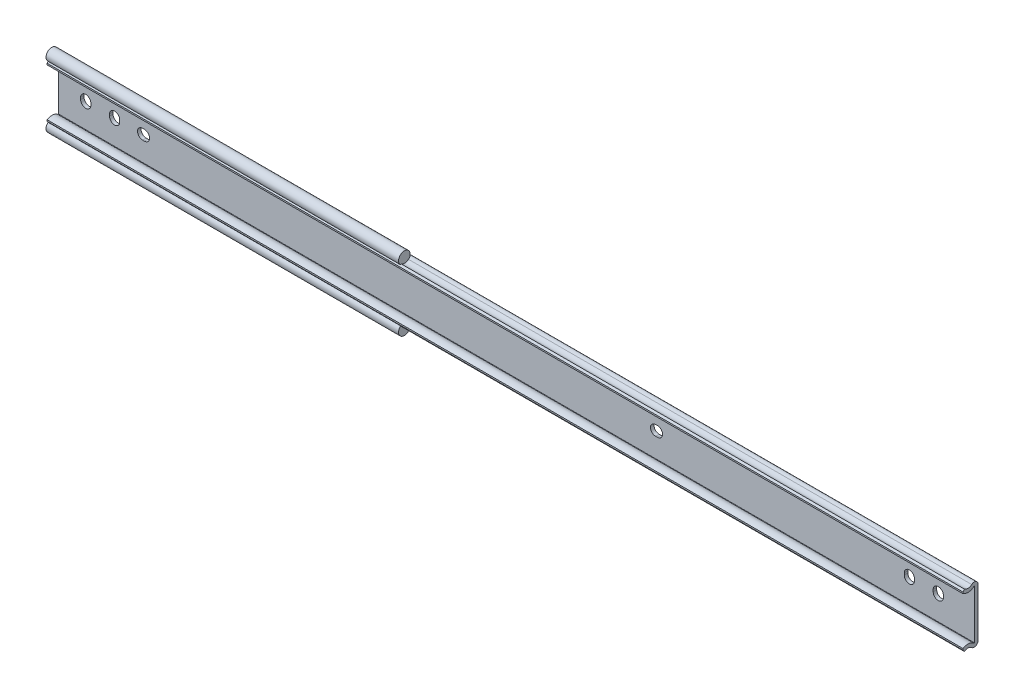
ISO-10303-21;
HEADER;
FILE_DESCRIPTION(('STEP AP214'),'2;1');
FILE_NAME('part.step','',(''),(''),'','','');
FILE_SCHEMA(('AUTOMOTIVE_DESIGN { 1 0 10303 214 1 1 1 1 }'));
ENDSEC;
DATA;
#1=APPLICATION_CONTEXT('core data for automotive mechanical design processes');
#2=APPLICATION_PROTOCOL_DEFINITION('international standard','automotive_design',2000,#1);
#3=PRODUCT_CONTEXT('',#1,'mechanical');
#4=PRODUCT('Part','Part','',(#3));
#5=PRODUCT_RELATED_PRODUCT_CATEGORY('part','',(#4));
#6=PRODUCT_DEFINITION_FORMATION('','',#4);
#7=PRODUCT_DEFINITION_CONTEXT('part definition',#1,'design');
#8=PRODUCT_DEFINITION('design','',#6,#7);
#9=PRODUCT_DEFINITION_SHAPE('','',#8);
#10=(LENGTH_UNIT() NAMED_UNIT(*) SI_UNIT(.MILLI.,.METRE.));
#11=(NAMED_UNIT(*) PLANE_ANGLE_UNIT() SI_UNIT($,.RADIAN.));
#12=(NAMED_UNIT(*) SI_UNIT($,.STERADIAN.) SOLID_ANGLE_UNIT());
#13=UNCERTAINTY_MEASURE_WITH_UNIT(LENGTH_MEASURE(1.E-05),#10,'distance_accuracy_value','');
#14=(GEOMETRIC_REPRESENTATION_CONTEXT(3) GLOBAL_UNCERTAINTY_ASSIGNED_CONTEXT((#13)) GLOBAL_UNIT_ASSIGNED_CONTEXT((#10,
#11,#12)) REPRESENTATION_CONTEXT('',''));
#15=CARTESIAN_POINT('',(0.,0.,0.));
#16=DIRECTION('',(0.,0.,1.));
#17=DIRECTION('',(1.,0.,0.));
#18=AXIS2_PLACEMENT_3D('',#15,#16,#17);
#19=CARTESIAN_POINT('',(147.,13.575,4.55));
#20=DIRECTION('',(-1.,0.,0.));
#21=DIRECTION('',(0.,0.,1.));
#22=AXIS2_PLACEMENT_3D('',#19,#20,#21);
#23=CYLINDRICAL_SURFACE('',#22,2.55);
#24=DIRECTION('',(-1.,0.,0.));
#25=VECTOR('',#24,1.);
#26=CARTESIAN_POINT('',(147.,11.6159967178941,6.18242339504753));
#27=LINE('',#26,#25);
#28=CARTESIAN_POINT('',(-11.9,11.6159967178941,6.18242339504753));
#29=VERTEX_POINT('',#28);
#30=CARTESIAN_POINT('',(143.,11.6159967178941,6.18242339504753));
#31=VERTEX_POINT('',#30);
#32=EDGE_CURVE('E22',#29,#31,#27,.F.);
#33=ORIENTED_EDGE('',*,*,#32,.T.);
#34=CARTESIAN_POINT('',(143.,13.575,4.55));
#35=DIRECTION('',(1.,0.,0.));
#36=DIRECTION('',(0.,0.,-1.));
#37=AXIS2_PLACEMENT_3D('',#34,#35,#36);
#38=CIRCLE('',#37,2.55);
#39=CARTESIAN_POINT('',(143.,12.266917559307,2.3610686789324));
#40=VERTEX_POINT('',#39);
#41=EDGE_CURVE('E294',#40,#31,#38,.T.);
#42=ORIENTED_EDGE('',*,*,#41,.F.);
#43=DIRECTION('',(-1.,0.,0.));
#44=VECTOR('',#43,1.);
#45=CARTESIAN_POINT('',(67.55,12.266917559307,2.36106867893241));
#46=LINE('',#45,#44);
#47=CARTESIAN_POINT('',(-11.9,12.266917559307,2.36106867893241));
#48=VERTEX_POINT('',#47);
#49=EDGE_CURVE('E581',#40,#48,#46,.T.);
#50=ORIENTED_EDGE('',*,*,#49,.T.);
#51=CARTESIAN_POINT('',(-11.9,13.575,4.55));
#52=DIRECTION('',(-1.,0.,0.));
#53=DIRECTION('',(0.,0.,1.));
#54=AXIS2_PLACEMENT_3D('',#51,#52,#53);
#55=CIRCLE('',#54,2.55);
#56=EDGE_CURVE('E305',#29,#48,#55,.T.);
#57=ORIENTED_EDGE('',*,*,#56,.F.);
#58=EDGE_LOOP('',(#33,#42,#50,#57));
#59=FACE_BOUND('',#58,.T.);
#60=ADVANCED_FACE('F14',(#59),#23,.T.);
#61=CARTESIAN_POINT('',(147.,-13.575,4.55));
#62=DIRECTION('',(-1.,0.,0.));
#63=DIRECTION('',(0.,0.,1.));
#64=AXIS2_PLACEMENT_3D('',#61,#62,#63);
#65=CYLINDRICAL_SURFACE('',#64,2.55);
#66=DIRECTION('',(-1.,0.,0.));
#67=VECTOR('',#66,1.);
#68=CARTESIAN_POINT('',(67.55,-12.2669175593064,2.36106867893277));
#69=LINE('',#68,#67);
#70=CARTESIAN_POINT('',(-11.9,-12.2669175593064,2.36106867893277));
#71=VERTEX_POINT('',#70);
#72=CARTESIAN_POINT('',(143.,-12.2669175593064,2.36106867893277));
#73=VERTEX_POINT('',#72);
#74=EDGE_CURVE('E29',#71,#73,#69,.F.);
#75=ORIENTED_EDGE('',*,*,#74,.T.);
#76=CARTESIAN_POINT('',(143.,-13.575,4.55));
#77=DIRECTION('',(1.,0.,0.));
#78=DIRECTION('',(0.,0.,-1.));
#79=AXIS2_PLACEMENT_3D('',#76,#77,#78);
#80=CIRCLE('',#79,2.55);
#81=CARTESIAN_POINT('',(143.,-11.615996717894,6.18242339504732));
#82=VERTEX_POINT('',#81);
#83=EDGE_CURVE('E595',#82,#73,#80,.T.);
#84=ORIENTED_EDGE('',*,*,#83,.F.);
#85=DIRECTION('',(-1.,0.,0.));
#86=VECTOR('',#85,1.);
#87=CARTESIAN_POINT('',(147.,-11.615996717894,6.18242339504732));
#88=LINE('',#87,#86);
#89=CARTESIAN_POINT('',(-11.9,-11.615996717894,6.18242339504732));
#90=VERTEX_POINT('',#89);
#91=EDGE_CURVE('E9',#82,#90,#88,.T.);
#92=ORIENTED_EDGE('',*,*,#91,.T.);
#93=CARTESIAN_POINT('',(-11.9,-13.575,4.55));
#94=DIRECTION('',(-1.,0.,0.));
#95=DIRECTION('',(0.,0.,-1.));
#96=AXIS2_PLACEMENT_3D('',#93,#94,#95);
#97=CIRCLE('',#96,2.55);
#98=EDGE_CURVE('E585',#71,#90,#97,.T.);
#99=ORIENTED_EDGE('',*,*,#98,.F.);
#100=EDGE_LOOP('',(#75,#84,#92,#99));
#101=FACE_BOUND('',#100,.T.);
#102=ADVANCED_FACE('F620',(#101),#65,.T.);
#103=CARTESIAN_POINT('',(-11.9,13.9150000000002,4.44999999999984));
#104=DIRECTION('',(1.,0.,0.));
#105=DIRECTION('',(0.,0.,-1.));
#106=AXIS2_PLACEMENT_3D('',#103,#104,#105);
#107=CYLINDRICAL_SURFACE('',#106,2.55000000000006);
#108=DIRECTION('',(1.,0.,0.));
#109=VECTOR('',#108,1.);
#110=CARTESIAN_POINT('',(-11.9,12.0059666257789,2.75941087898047));
#111=LINE('',#110,#109);
#112=CARTESIAN_POINT('',(143.,12.0059666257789,2.75941087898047));
#113=VERTEX_POINT('',#112);
#114=CARTESIAN_POINT('',(390.5,12.0059666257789,2.75941087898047));
#115=VERTEX_POINT('',#114);
#116=EDGE_CURVE('E361',#113,#115,#111,.T.);
#117=ORIENTED_EDGE('',*,*,#116,.F.);
#118=CARTESIAN_POINT('',(143.,13.9150000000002,4.44999999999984));
#119=DIRECTION('',(1.,0.,0.));
#120=DIRECTION('',(0.,0.,-1.));
#121=AXIS2_PLACEMENT_3D('',#118,#119,#120);
#122=CIRCLE('',#121,2.55);
#123=CARTESIAN_POINT('',(143.,11.8784795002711,5.98462837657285));
#124=VERTEX_POINT('',#123);
#125=EDGE_CURVE('E293',#124,#113,#122,.T.);
#126=ORIENTED_EDGE('',*,*,#125,.F.);
#127=DIRECTION('',(1.,0.,0.));
#128=VECTOR('',#127,1.);
#129=CARTESIAN_POINT('',(-11.9,11.8784795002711,5.98462837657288));
#130=LINE('',#129,#128);
#131=CARTESIAN_POINT('',(390.5,11.8784795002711,5.98462837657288));
#132=VERTEX_POINT('',#131);
#133=EDGE_CURVE('E289',#124,#132,#130,.T.);
#134=ORIENTED_EDGE('',*,*,#133,.T.);
#135=CARTESIAN_POINT('',(390.5,13.9150000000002,4.44999999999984));
#136=DIRECTION('',(-1.,0.,0.));
#137=DIRECTION('',(0.,0.,1.));
#138=AXIS2_PLACEMENT_3D('',#135,#136,#137);
#139=CIRCLE('',#138,2.55000000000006);
#140=EDGE_CURVE('E458',#115,#132,#139,.T.);
#141=ORIENTED_EDGE('',*,*,#140,.F.);
#142=EDGE_LOOP('',(#117,#126,#134,#141));
#143=FACE_BOUND('',#142,.T.);
#144=ADVANCED_FACE('F16',(#143),#107,.F.);
#145=CARTESIAN_POINT('',(-11.9,-10.7622239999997,0.));
#146=DIRECTION('',(0.,0.,-1.));
#147=DIRECTION('',(-1.,0.,0.));
#148=AXIS2_PLACEMENT_3D('',#145,#146,#147);
#149=PLANE('',#148);
#150=DIRECTION('',(0.,1.,0.));
#151=VECTOR('',#150,1.);
#152=CARTESIAN_POINT('',(-11.9,-10.7622239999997,0.));
#153=LINE('',#152,#151);
#154=CARTESIAN_POINT('',(-11.9,-10.7622239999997,0.));
#155=VERTEX_POINT('',#154);
#156=CARTESIAN_POINT('',(-11.9,10.7622240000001,0.));
#157=VERTEX_POINT('',#156);
#158=EDGE_CURVE('E392',#155,#157,#153,.T.);
#159=ORIENTED_EDGE('',*,*,#158,.T.);
#160=DIRECTION('',(1.,0.,0.));
#161=VECTOR('',#160,1.);
#162=CARTESIAN_POINT('',(-11.9,10.7622240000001,0.));
#163=LINE('',#162,#161);
#164=CARTESIAN_POINT('',(390.5,10.7622240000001,0.));
#165=VERTEX_POINT('',#164);
#166=EDGE_CURVE('E387',#157,#165,#163,.T.);
#167=ORIENTED_EDGE('',*,*,#166,.T.);
#168=DIRECTION('',(0.,1.,0.));
#169=VECTOR('',#168,1.);
#170=CARTESIAN_POINT('',(390.5,-10.7622239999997,0.));
#171=LINE('',#170,#169);
#172=CARTESIAN_POINT('',(390.5,-10.7622239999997,0.));
#173=VERTEX_POINT('',#172);
#174=EDGE_CURVE('E423',#173,#165,#171,.T.);
#175=ORIENTED_EDGE('',*,*,#174,.F.);
#176=DIRECTION('',(1.,0.,0.));
#177=VECTOR('',#176,1.);
#178=CARTESIAN_POINT('',(-11.9,-10.7622239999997,0.));
#179=LINE('',#178,#177);
#180=EDGE_CURVE('E384',#155,#173,#179,.T.);
#181=ORIENTED_EDGE('',*,*,#180,.F.);
#182=EDGE_LOOP('',(#159,#167,#175,#181));
#183=FACE_BOUND('',#182,.T.);
#184=CARTESIAN_POINT('',(251.2,2.32452945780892E-13,0.));
#185=DIRECTION('',(0.,0.,-1.));
#186=DIRECTION('',(-1.,0.,0.));
#187=AXIS2_PLACEMENT_3D('',#184,#185,#186);
#188=CIRCLE('',#187,2.25);
#189=CARTESIAN_POINT('',(251.2,2.25000000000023,0.));
#190=VERTEX_POINT('',#189);
#191=CARTESIAN_POINT('',(251.2,-2.24999999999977,0.));
#192=VERTEX_POINT('',#191);
#193=EDGE_CURVE('E579',#190,#192,#188,.T.);
#194=ORIENTED_EDGE('',*,*,#193,.F.);
#195=DIRECTION('',(1.,0.,0.));
#196=VECTOR('',#195,1.);
#197=CARTESIAN_POINT('',(251.2,2.25000000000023,0.));
#198=LINE('',#197,#196);
#199=CARTESIAN_POINT('',(250.4,2.25000000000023,0.));
#200=VERTEX_POINT('',#199);
#201=EDGE_CURVE('E566',#200,#190,#198,.T.);
#202=ORIENTED_EDGE('',*,*,#201,.F.);
#203=CARTESIAN_POINT('',(250.4,2.32452945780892E-13,0.));
#204=DIRECTION('',(0.,0.,-1.));
#205=DIRECTION('',(-1.,0.,0.));
#206=AXIS2_PLACEMENT_3D('',#203,#204,#205);
#207=CIRCLE('',#206,2.25);
#208=CARTESIAN_POINT('',(250.4,-2.24999999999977,0.));
#209=VERTEX_POINT('',#208);
#210=EDGE_CURVE('E573',#209,#200,#207,.T.);
#211=ORIENTED_EDGE('',*,*,#210,.F.);
#212=DIRECTION('',(-1.,0.,0.));
#213=VECTOR('',#212,1.);
#214=CARTESIAN_POINT('',(251.2,-2.24999999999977,0.));
#215=LINE('',#214,#213);
#216=EDGE_CURVE('E576',#192,#209,#215,.T.);
#217=ORIENTED_EDGE('',*,*,#216,.F.);
#218=EDGE_LOOP('',(#194,#202,#211,#217));
#219=FACE_BOUND('',#218,.T.);
#220=CARTESIAN_POINT('',(25.000000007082,0.00222400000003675,0.));
#221=DIRECTION('',(0.,0.,-1.));
#222=DIRECTION('',(-1.,0.,0.));
#223=AXIS2_PLACEMENT_3D('',#220,#221,#222);
#224=CIRCLE('',#223,2.25);
#225=CARTESIAN_POINT('',(25.000000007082,-2.24777599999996,0.));
#226=VERTEX_POINT('',#225);
#227=CARTESIAN_POINT('',(25.000000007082,2.25222400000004,0.));
#228=VERTEX_POINT('',#227);
#229=EDGE_CURVE('E559',#226,#228,#224,.T.);
#230=ORIENTED_EDGE('',*,*,#229,.F.);
#231=DIRECTION('',(-1.,0.,0.));
#232=VECTOR('',#231,1.);
#233=CARTESIAN_POINT('',(25.800000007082,-2.24777599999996,0.));
#234=LINE('',#233,#232);
#235=CARTESIAN_POINT('',(25.800000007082,-2.24777599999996,0.));
#236=VERTEX_POINT('',#235);
#237=EDGE_CURVE('E546',#236,#226,#234,.T.);
#238=ORIENTED_EDGE('',*,*,#237,.F.);
#239=CARTESIAN_POINT('',(25.800000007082,0.00222400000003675,0.));
#240=DIRECTION('',(0.,0.,-1.));
#241=DIRECTION('',(-1.,0.,0.));
#242=AXIS2_PLACEMENT_3D('',#239,#240,#241);
#243=CIRCLE('',#242,2.25);
#244=CARTESIAN_POINT('',(25.800000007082,2.25222400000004,0.));
#245=VERTEX_POINT('',#244);
#246=EDGE_CURVE('E553',#245,#236,#243,.T.);
#247=ORIENTED_EDGE('',*,*,#246,.F.);
#248=DIRECTION('',(1.,0.,0.));
#249=VECTOR('',#248,1.);
#250=CARTESIAN_POINT('',(25.000000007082,2.25222400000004,0.));
#251=LINE('',#250,#249);
#252=EDGE_CURVE('E556',#228,#245,#251,.T.);
#253=ORIENTED_EDGE('',*,*,#252,.F.);
#254=EDGE_LOOP('',(#230,#238,#247,#253));
#255=FACE_BOUND('',#254,.T.);
#256=CARTESIAN_POINT('',(0.,-0.400000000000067,0.));
#257=DIRECTION('',(0.,0.,-1.));
#258=DIRECTION('',(1.,0.,0.));
#259=AXIS2_PLACEMENT_3D('',#256,#257,#258);
#260=CIRCLE('',#259,2.24999999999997);
#261=CARTESIAN_POINT('',(2.25000000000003,-0.400000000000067,0.));
#262=VERTEX_POINT('',#261);
#263=CARTESIAN_POINT('',(-2.24999999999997,-0.400000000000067,0.));
#264=VERTEX_POINT('',#263);
#265=EDGE_CURVE('E539',#262,#264,#260,.T.);
#266=ORIENTED_EDGE('',*,*,#265,.F.);
#267=DIRECTION('',(0.,-1.,0.));
#268=VECTOR('',#267,1.);
#269=CARTESIAN_POINT('',(2.25000000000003,-0.400000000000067,0.));
#270=LINE('',#269,#268);
#271=CARTESIAN_POINT('',(2.25000000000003,0.400000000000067,0.));
#272=VERTEX_POINT('',#271);
#273=EDGE_CURVE('E526',#272,#262,#270,.T.);
#274=ORIENTED_EDGE('',*,*,#273,.F.);
#275=CARTESIAN_POINT('',(0.,0.400000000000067,0.));
#276=DIRECTION('',(0.,0.,-1.));
#277=DIRECTION('',(1.,0.,0.));
#278=AXIS2_PLACEMENT_3D('',#275,#276,#277);
#279=CIRCLE('',#278,2.24999999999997);
#280=CARTESIAN_POINT('',(-2.24999999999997,0.400000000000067,0.));
#281=VERTEX_POINT('',#280);
#282=EDGE_CURVE('E533',#281,#272,#279,.T.);
#283=ORIENTED_EDGE('',*,*,#282,.F.);
#284=DIRECTION('',(0.,1.,0.));
#285=VECTOR('',#284,1.);
#286=CARTESIAN_POINT('',(-2.24999999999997,-0.400000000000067,0.));
#287=LINE('',#286,#285);
#288=EDGE_CURVE('E536',#264,#281,#287,.T.);
#289=ORIENTED_EDGE('',*,*,#288,.F.);
#290=EDGE_LOOP('',(#266,#274,#283,#289));
#291=FACE_BOUND('',#290,.T.);
#292=CARTESIAN_POINT('',(12.7,-0.400000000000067,0.));
#293=DIRECTION('',(0.,0.,-1.));
#294=DIRECTION('',(1.,0.,0.));
#295=AXIS2_PLACEMENT_3D('',#292,#293,#294);
#296=CIRCLE('',#295,2.24999999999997);
#297=CARTESIAN_POINT('',(14.95,-0.400000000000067,0.));
#298=VERTEX_POINT('',#297);
#299=CARTESIAN_POINT('',(10.45,-0.400000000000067,0.));
#300=VERTEX_POINT('',#299);
#301=EDGE_CURVE('E519',#298,#300,#296,.T.);
#302=ORIENTED_EDGE('',*,*,#301,.F.);
#303=DIRECTION('',(0.,-1.,0.));
#304=VECTOR('',#303,1.);
#305=CARTESIAN_POINT('',(14.95,-0.400000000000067,0.));
#306=LINE('',#305,#304);
#307=CARTESIAN_POINT('',(14.95,0.400000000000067,0.));
#308=VERTEX_POINT('',#307);
#309=EDGE_CURVE('E506',#308,#298,#306,.T.);
#310=ORIENTED_EDGE('',*,*,#309,.F.);
#311=CARTESIAN_POINT('',(12.7,0.400000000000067,0.));
#312=DIRECTION('',(0.,0.,-1.));
#313=DIRECTION('',(1.,0.,0.));
#314=AXIS2_PLACEMENT_3D('',#311,#312,#313);
#315=CIRCLE('',#314,2.24999999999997);
#316=CARTESIAN_POINT('',(10.45,0.400000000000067,0.));
#317=VERTEX_POINT('',#316);
#318=EDGE_CURVE('E513',#317,#308,#315,.T.);
#319=ORIENTED_EDGE('',*,*,#318,.F.);
#320=DIRECTION('',(0.,1.,0.));
#321=VECTOR('',#320,1.);
#322=CARTESIAN_POINT('',(10.45,-0.400000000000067,0.));
#323=LINE('',#322,#321);
#324=EDGE_CURVE('E516',#300,#317,#323,.T.);
#325=ORIENTED_EDGE('',*,*,#324,.F.);
#326=EDGE_LOOP('',(#302,#310,#319,#325));
#327=FACE_BOUND('',#326,.T.);
#328=CARTESIAN_POINT('',(361.9,-0.400000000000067,0.));
#329=DIRECTION('',(0.,0.,-1.));
#330=DIRECTION('',(1.,0.,0.));
#331=AXIS2_PLACEMENT_3D('',#328,#329,#330);
#332=CIRCLE('',#331,2.24999999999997);
#333=CARTESIAN_POINT('',(364.15,-0.400000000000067,0.));
#334=VERTEX_POINT('',#333);
#335=CARTESIAN_POINT('',(359.65,-0.400000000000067,0.));
#336=VERTEX_POINT('',#335);
#337=EDGE_CURVE('E499',#334,#336,#332,.T.);
#338=ORIENTED_EDGE('',*,*,#337,.F.);
#339=DIRECTION('',(0.,-1.,0.));
#340=VECTOR('',#339,1.);
#341=CARTESIAN_POINT('',(364.15,-0.400000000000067,0.));
#342=LINE('',#341,#340);
#343=CARTESIAN_POINT('',(364.15,0.400000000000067,0.));
#344=VERTEX_POINT('',#343);
#345=EDGE_CURVE('E486',#344,#334,#342,.T.);
#346=ORIENTED_EDGE('',*,*,#345,.F.);
#347=CARTESIAN_POINT('',(361.9,0.400000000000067,0.));
#348=DIRECTION('',(0.,0.,-1.));
#349=DIRECTION('',(1.,0.,0.));
#350=AXIS2_PLACEMENT_3D('',#347,#348,#349);
#351=CIRCLE('',#350,2.24999999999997);
#352=CARTESIAN_POINT('',(359.65,0.400000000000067,0.));
#353=VERTEX_POINT('',#352);
#354=EDGE_CURVE('E493',#353,#344,#351,.T.);
#355=ORIENTED_EDGE('',*,*,#354,.F.);
#356=DIRECTION('',(0.,1.,0.));
#357=VECTOR('',#356,1.);
#358=CARTESIAN_POINT('',(359.65,-0.400000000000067,0.));
#359=LINE('',#358,#357);
#360=EDGE_CURVE('E496',#336,#353,#359,.T.);
#361=ORIENTED_EDGE('',*,*,#360,.F.);
#362=EDGE_LOOP('',(#338,#346,#355,#361));
#363=FACE_BOUND('',#362,.T.);
#364=CARTESIAN_POINT('',(374.6,-0.400000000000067,0.));
#365=DIRECTION('',(0.,0.,-1.));
#366=DIRECTION('',(1.,0.,0.));
#367=AXIS2_PLACEMENT_3D('',#364,#365,#366);
#368=CIRCLE('',#367,2.24999999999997);
#369=CARTESIAN_POINT('',(376.85,-0.400000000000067,0.));
#370=VERTEX_POINT('',#369);
#371=CARTESIAN_POINT('',(372.35,-0.400000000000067,0.));
#372=VERTEX_POINT('',#371);
#373=EDGE_CURVE('E479',#370,#372,#368,.T.);
#374=ORIENTED_EDGE('',*,*,#373,.F.);
#375=DIRECTION('',(0.,-1.,0.));
#376=VECTOR('',#375,1.);
#377=CARTESIAN_POINT('',(376.85,-0.400000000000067,0.));
#378=LINE('',#377,#376);
#379=CARTESIAN_POINT('',(376.85,0.400000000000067,0.));
#380=VERTEX_POINT('',#379);
#381=EDGE_CURVE('E466',#380,#370,#378,.T.);
#382=ORIENTED_EDGE('',*,*,#381,.F.);
#383=CARTESIAN_POINT('',(374.6,0.400000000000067,0.));
#384=DIRECTION('',(0.,0.,-1.));
#385=DIRECTION('',(1.,0.,0.));
#386=AXIS2_PLACEMENT_3D('',#383,#384,#385);
#387=CIRCLE('',#386,2.24999999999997);
#388=CARTESIAN_POINT('',(372.35,0.400000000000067,0.));
#389=VERTEX_POINT('',#388);
#390=EDGE_CURVE('E473',#389,#380,#387,.T.);
#391=ORIENTED_EDGE('',*,*,#390,.F.);
#392=DIRECTION('',(0.,1.,0.));
#393=VECTOR('',#392,1.);
#394=CARTESIAN_POINT('',(372.35,-0.400000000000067,0.));
#395=LINE('',#394,#393);
#396=EDGE_CURVE('E476',#372,#389,#395,.T.);
#397=ORIENTED_EDGE('',*,*,#396,.F.);
#398=EDGE_LOOP('',(#374,#382,#391,#397));
#399=FACE_BOUND('',#398,.T.);
#400=ADVANCED_FACE('F619',(#183,#219,#255,#291,#327,#363,#399),#149,.T.);
#401=CARTESIAN_POINT('',(-11.9,10.7622240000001,1.54999999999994));
#402=DIRECTION('',(0.,0.,1.));
#403=DIRECTION('',(1.,0.,0.));
#404=AXIS2_PLACEMENT_3D('',#401,#402,#403);
#405=PLANE('',#404);
#406=DIRECTION('',(0.,-1.,0.));
#407=VECTOR('',#406,1.);
#408=CARTESIAN_POINT('',(-11.9,10.7622240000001,1.54999999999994));
#409=LINE('',#408,#407);
#410=CARTESIAN_POINT('',(-11.9,10.7622240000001,1.54999999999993));
#411=VERTEX_POINT('',#410);
#412=CARTESIAN_POINT('',(-11.9,-10.7622239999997,1.54999999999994));
#413=VERTEX_POINT('',#412);
#414=EDGE_CURVE('E407',#411,#413,#409,.T.);
#415=ORIENTED_EDGE('',*,*,#414,.T.);
#416=DIRECTION('',(1.,0.,0.));
#417=VECTOR('',#416,1.);
#418=CARTESIAN_POINT('',(-11.9,-10.7622239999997,1.54999999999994));
#419=LINE('',#418,#417);
#420=CARTESIAN_POINT('',(390.5,-10.7622239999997,1.54999999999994));
#421=VERTEX_POINT('',#420);
#422=EDGE_CURVE('E372',#413,#421,#419,.T.);
#423=ORIENTED_EDGE('',*,*,#422,.T.);
#424=DIRECTION('',(0.,-1.,0.));
#425=VECTOR('',#424,1.);
#426=CARTESIAN_POINT('',(390.5,10.7622240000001,1.54999999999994));
#427=LINE('',#426,#425);
#428=CARTESIAN_POINT('',(390.5,10.7622240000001,1.54999999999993));
#429=VERTEX_POINT('',#428);
#430=EDGE_CURVE('E443',#429,#421,#427,.T.);
#431=ORIENTED_EDGE('',*,*,#430,.F.);
#432=DIRECTION('',(1.,0.,0.));
#433=VECTOR('',#432,1.);
#434=CARTESIAN_POINT('',(-11.9,10.7622240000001,1.54999999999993));
#435=LINE('',#434,#433);
#436=EDGE_CURVE('E370',#411,#429,#435,.T.);
#437=ORIENTED_EDGE('',*,*,#436,.F.);
#438=EDGE_LOOP('',(#415,#423,#431,#437));
#439=FACE_BOUND('',#438,.T.);
#440=CARTESIAN_POINT('',(251.2,2.32452945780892E-13,1.54999999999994));
#441=DIRECTION('',(0.,0.,1.));
#442=DIRECTION('',(1.,0.,0.));
#443=AXIS2_PLACEMENT_3D('',#440,#441,#442);
#444=CIRCLE('',#443,2.25);
#445=CARTESIAN_POINT('',(251.2,-2.24999999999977,1.54999999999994));
#446=VERTEX_POINT('',#445);
#447=CARTESIAN_POINT('',(251.2,2.25000000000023,1.54999999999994));
#448=VERTEX_POINT('',#447);
#449=EDGE_CURVE('E306',#446,#448,#444,.T.);
#450=ORIENTED_EDGE('',*,*,#449,.F.);
#451=DIRECTION('',(1.,0.,0.));
#452=VECTOR('',#451,1.);
#453=CARTESIAN_POINT('',(-11.9,-2.24999999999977,1.54999999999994));
#454=LINE('',#453,#452);
#455=CARTESIAN_POINT('',(250.4,-2.24999999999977,1.54999999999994));
#456=VERTEX_POINT('',#455);
#457=EDGE_CURVE('E314',#456,#446,#454,.T.);
#458=ORIENTED_EDGE('',*,*,#457,.F.);
#459=CARTESIAN_POINT('',(250.4,2.32452945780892E-13,1.54999999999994));
#460=DIRECTION('',(0.,0.,1.));
#461=DIRECTION('',(1.,0.,0.));
#462=AXIS2_PLACEMENT_3D('',#459,#460,#461);
#463=CIRCLE('',#462,2.25);
#464=CARTESIAN_POINT('',(250.4,2.25000000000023,1.54999999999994));
#465=VERTEX_POINT('',#464);
#466=EDGE_CURVE('E311',#465,#456,#463,.T.);
#467=ORIENTED_EDGE('',*,*,#466,.F.);
#468=DIRECTION('',(-1.,0.,0.));
#469=VECTOR('',#468,1.);
#470=CARTESIAN_POINT('',(-11.9,2.25000000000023,1.54999999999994));
#471=LINE('',#470,#469);
#472=EDGE_CURVE('E307',#448,#465,#471,.T.);
#473=ORIENTED_EDGE('',*,*,#472,.F.);
#474=EDGE_LOOP('',(#450,#458,#467,#473));
#475=FACE_BOUND('',#474,.T.);
#476=CARTESIAN_POINT('',(25.000000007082,0.00222400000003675,1.54999999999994));
#477=DIRECTION('',(0.,0.,1.));
#478=DIRECTION('',(1.,0.,0.));
#479=AXIS2_PLACEMENT_3D('',#476,#477,#478);
#480=CIRCLE('',#479,2.25);
#481=CARTESIAN_POINT('',(25.000000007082,2.25222400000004,1.54999999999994));
#482=VERTEX_POINT('',#481);
#483=CARTESIAN_POINT('',(25.000000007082,-2.24777599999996,1.54999999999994));
#484=VERTEX_POINT('',#483);
#485=EDGE_CURVE('E316',#482,#484,#480,.T.);
#486=ORIENTED_EDGE('',*,*,#485,.F.);
#487=DIRECTION('',(-1.,0.,0.));
#488=VECTOR('',#487,1.);
#489=CARTESIAN_POINT('',(-11.9,2.25222400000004,1.54999999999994));
#490=LINE('',#489,#488);
#491=CARTESIAN_POINT('',(25.800000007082,2.25222400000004,1.54999999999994));
#492=VERTEX_POINT('',#491);
#493=EDGE_CURVE('E323',#492,#482,#490,.T.);
#494=ORIENTED_EDGE('',*,*,#493,.F.);
#495=CARTESIAN_POINT('',(25.800000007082,0.00222400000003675,1.54999999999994));
#496=DIRECTION('',(0.,0.,1.));
#497=DIRECTION('',(1.,0.,0.));
#498=AXIS2_PLACEMENT_3D('',#495,#496,#497);
#499=CIRCLE('',#498,2.25);
#500=CARTESIAN_POINT('',(25.800000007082,-2.24777599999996,1.54999999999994));
#501=VERTEX_POINT('',#500);
#502=EDGE_CURVE('E320',#501,#492,#499,.T.);
#503=ORIENTED_EDGE('',*,*,#502,.F.);
#504=DIRECTION('',(1.,0.,0.));
#505=VECTOR('',#504,1.);
#506=CARTESIAN_POINT('',(-11.9,-2.24777599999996,1.54999999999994));
#507=LINE('',#506,#505);
#508=EDGE_CURVE('E318',#484,#501,#507,.T.);
#509=ORIENTED_EDGE('',*,*,#508,.F.);
#510=EDGE_LOOP('',(#486,#494,#503,#509));
#511=FACE_BOUND('',#510,.T.);
#512=CARTESIAN_POINT('',(0.,-0.400000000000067,1.54999999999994));
#513=DIRECTION('',(0.,0.,1.));
#514=DIRECTION('',(1.,0.,0.));
#515=AXIS2_PLACEMENT_3D('',#512,#513,#514);
#516=CIRCLE('',#515,2.24999999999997);
#517=CARTESIAN_POINT('',(-2.24999999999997,-0.400000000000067,1.54999999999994));
#518=VERTEX_POINT('',#517);
#519=CARTESIAN_POINT('',(2.25000000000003,-0.400000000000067,1.54999999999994));
#520=VERTEX_POINT('',#519);
#521=EDGE_CURVE('E325',#518,#520,#516,.T.);
#522=ORIENTED_EDGE('',*,*,#521,.F.);
#523=DIRECTION('',(0.,-1.,0.));
#524=VECTOR('',#523,1.);
#525=CARTESIAN_POINT('',(-2.24999999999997,10.7622240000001,1.54999999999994));
#526=LINE('',#525,#524);
#527=CARTESIAN_POINT('',(-2.24999999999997,0.400000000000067,1.54999999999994));
#528=VERTEX_POINT('',#527);
#529=EDGE_CURVE('E332',#528,#518,#526,.T.);
#530=ORIENTED_EDGE('',*,*,#529,.F.);
#531=CARTESIAN_POINT('',(0.,0.400000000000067,1.54999999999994));
#532=DIRECTION('',(0.,0.,1.));
#533=DIRECTION('',(1.,0.,0.));
#534=AXIS2_PLACEMENT_3D('',#531,#532,#533);
#535=CIRCLE('',#534,2.24999999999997);
#536=CARTESIAN_POINT('',(2.25000000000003,0.400000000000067,1.54999999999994));
#537=VERTEX_POINT('',#536);
#538=EDGE_CURVE('E329',#537,#528,#535,.T.);
#539=ORIENTED_EDGE('',*,*,#538,.F.);
#540=DIRECTION('',(0.,1.,0.));
#541=VECTOR('',#540,1.);
#542=CARTESIAN_POINT('',(2.25000000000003,10.7622240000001,1.54999999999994));
#543=LINE('',#542,#541);
#544=EDGE_CURVE('E327',#520,#537,#543,.T.);
#545=ORIENTED_EDGE('',*,*,#544,.F.);
#546=EDGE_LOOP('',(#522,#530,#539,#545));
#547=FACE_BOUND('',#546,.T.);
#548=CARTESIAN_POINT('',(12.7,-0.400000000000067,1.54999999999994));
#549=DIRECTION('',(0.,0.,1.));
#550=DIRECTION('',(1.,0.,0.));
#551=AXIS2_PLACEMENT_3D('',#548,#549,#550);
#552=CIRCLE('',#551,2.24999999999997);
#553=CARTESIAN_POINT('',(10.45,-0.400000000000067,1.54999999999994));
#554=VERTEX_POINT('',#553);
#555=CARTESIAN_POINT('',(14.95,-0.400000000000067,1.54999999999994));
#556=VERTEX_POINT('',#555);
#557=EDGE_CURVE('E334',#554,#556,#552,.T.);
#558=ORIENTED_EDGE('',*,*,#557,.F.);
#559=DIRECTION('',(0.,-1.,0.));
#560=VECTOR('',#559,1.);
#561=CARTESIAN_POINT('',(10.45,10.7622240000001,1.54999999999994));
#562=LINE('',#561,#560);
#563=CARTESIAN_POINT('',(10.45,0.400000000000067,1.54999999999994));
#564=VERTEX_POINT('',#563);
#565=EDGE_CURVE('E341',#564,#554,#562,.T.);
#566=ORIENTED_EDGE('',*,*,#565,.F.);
#567=CARTESIAN_POINT('',(12.7,0.400000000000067,1.54999999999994));
#568=DIRECTION('',(0.,0.,1.));
#569=DIRECTION('',(1.,0.,0.));
#570=AXIS2_PLACEMENT_3D('',#567,#568,#569);
#571=CIRCLE('',#570,2.24999999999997);
#572=CARTESIAN_POINT('',(14.95,0.400000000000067,1.54999999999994));
#573=VERTEX_POINT('',#572);
#574=EDGE_CURVE('E338',#573,#564,#571,.T.);
#575=ORIENTED_EDGE('',*,*,#574,.F.);
#576=DIRECTION('',(0.,1.,0.));
#577=VECTOR('',#576,1.);
#578=CARTESIAN_POINT('',(14.95,10.7622240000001,1.54999999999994));
#579=LINE('',#578,#577);
#580=EDGE_CURVE('E336',#556,#573,#579,.T.);
#581=ORIENTED_EDGE('',*,*,#580,.F.);
#582=EDGE_LOOP('',(#558,#566,#575,#581));
#583=FACE_BOUND('',#582,.T.);
#584=CARTESIAN_POINT('',(361.9,-0.400000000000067,1.54999999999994));
#585=DIRECTION('',(0.,0.,1.));
#586=DIRECTION('',(1.,0.,0.));
#587=AXIS2_PLACEMENT_3D('',#584,#585,#586);
#588=CIRCLE('',#587,2.24999999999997);
#589=CARTESIAN_POINT('',(359.65,-0.400000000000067,1.54999999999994));
#590=VERTEX_POINT('',#589);
#591=CARTESIAN_POINT('',(364.15,-0.400000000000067,1.54999999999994));
#592=VERTEX_POINT('',#591);
#593=EDGE_CURVE('E343',#590,#592,#588,.T.);
#594=ORIENTED_EDGE('',*,*,#593,.F.);
#595=DIRECTION('',(0.,-1.,0.));
#596=VECTOR('',#595,1.);
#597=CARTESIAN_POINT('',(359.65,10.7622240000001,1.54999999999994));
#598=LINE('',#597,#596);
#599=CARTESIAN_POINT('',(359.65,0.400000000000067,1.54999999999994));
#600=VERTEX_POINT('',#599);
#601=EDGE_CURVE('E350',#600,#590,#598,.T.);
#602=ORIENTED_EDGE('',*,*,#601,.F.);
#603=CARTESIAN_POINT('',(361.9,0.400000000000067,1.54999999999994));
#604=DIRECTION('',(0.,0.,1.));
#605=DIRECTION('',(1.,0.,0.));
#606=AXIS2_PLACEMENT_3D('',#603,#604,#605);
#607=CIRCLE('',#606,2.24999999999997);
#608=CARTESIAN_POINT('',(364.15,0.400000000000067,1.54999999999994));
#609=VERTEX_POINT('',#608);
#610=EDGE_CURVE('E347',#609,#600,#607,.T.);
#611=ORIENTED_EDGE('',*,*,#610,.F.);
#612=DIRECTION('',(0.,1.,0.));
#613=VECTOR('',#612,1.);
#614=CARTESIAN_POINT('',(364.15,10.7622240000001,1.54999999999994));
#615=LINE('',#614,#613);
#616=EDGE_CURVE('E345',#592,#609,#615,.T.);
#617=ORIENTED_EDGE('',*,*,#616,.F.);
#618=EDGE_LOOP('',(#594,#602,#611,#617));
#619=FACE_BOUND('',#618,.T.);
#620=CARTESIAN_POINT('',(374.6,-0.400000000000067,1.54999999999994));
#621=DIRECTION('',(0.,0.,1.));
#622=DIRECTION('',(1.,0.,0.));
#623=AXIS2_PLACEMENT_3D('',#620,#621,#622);
#624=CIRCLE('',#623,2.24999999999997);
#625=CARTESIAN_POINT('',(372.35,-0.400000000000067,1.54999999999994));
#626=VERTEX_POINT('',#625);
#627=CARTESIAN_POINT('',(376.85,-0.400000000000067,1.54999999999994));
#628=VERTEX_POINT('',#627);
#629=EDGE_CURVE('E352',#626,#628,#624,.T.);
#630=ORIENTED_EDGE('',*,*,#629,.F.);
#631=DIRECTION('',(0.,-1.,0.));
#632=VECTOR('',#631,1.);
#633=CARTESIAN_POINT('',(372.35,10.7622240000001,1.54999999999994));
#634=LINE('',#633,#632);
#635=CARTESIAN_POINT('',(372.35,0.400000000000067,1.54999999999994));
#636=VERTEX_POINT('',#635);
#637=EDGE_CURVE('E359',#636,#626,#634,.T.);
#638=ORIENTED_EDGE('',*,*,#637,.F.);
#639=CARTESIAN_POINT('',(374.6,0.400000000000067,1.54999999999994));
#640=DIRECTION('',(0.,0.,1.));
#641=DIRECTION('',(1.,0.,0.));
#642=AXIS2_PLACEMENT_3D('',#639,#640,#641);
#643=CIRCLE('',#642,2.24999999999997);
#644=CARTESIAN_POINT('',(376.85,0.400000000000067,1.54999999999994));
#645=VERTEX_POINT('',#644);
#646=EDGE_CURVE('E356',#645,#636,#643,.T.);
#647=ORIENTED_EDGE('',*,*,#646,.F.);
#648=DIRECTION('',(0.,1.,0.));
#649=VECTOR('',#648,1.);
#650=CARTESIAN_POINT('',(376.85,10.7622240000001,1.54999999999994));
#651=LINE('',#650,#649);
#652=EDGE_CURVE('E354',#628,#645,#651,.T.);
#653=ORIENTED_EDGE('',*,*,#652,.F.);
#654=EDGE_LOOP('',(#630,#638,#647,#653));
#655=FACE_BOUND('',#654,.T.);
#656=ADVANCED_FACE('F627',(#439,#475,#511,#547,#583,#619,#655),#405,.T.);
#657=CARTESIAN_POINT('',(-11.9,13.9150000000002,4.44999999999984));
#658=DIRECTION('',(-1.,0.,0.));
#659=DIRECTION('',(0.,0.,1.));
#660=AXIS2_PLACEMENT_3D('',#657,#658,#659);
#661=PLANE('',#660);
#662=CARTESIAN_POINT('',(-11.9,-10.7622239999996,1.66));
#663=DIRECTION('',(1.,0.,0.));
#664=DIRECTION('',(0.,0.,1.));
#665=AXIS2_PLACEMENT_3D('',#662,#663,#664);
#666=CIRCLE('',#665,1.66);
#667=EDGE_CURVE('E394',#71,#155,#666,.T.);
#668=ORIENTED_EDGE('',*,*,#667,.F.);
#669=ORIENTED_EDGE('',*,*,#98,.T.);
#670=DIRECTION('',(0.,-0.798635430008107,-0.60181512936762));
#671=VECTOR('',#670,1.);
#672=CARTESIAN_POINT('',(-11.9,-11.8784795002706,5.98462837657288));
#673=LINE('',#672,#671);
#674=CARTESIAN_POINT('',(-11.9,-11.0618539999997,6.6));
#675=VERTEX_POINT('',#674);
#676=EDGE_CURVE('E396',#675,#90,#673,.T.);
#677=ORIENTED_EDGE('',*,*,#676,.F.);
#678=DIRECTION('',(0.,-1.,0.));
#679=VECTOR('',#678,1.);
#680=CARTESIAN_POINT('',(-11.9,-11.0618539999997,6.6));
#681=LINE('',#680,#679);
#682=CARTESIAN_POINT('',(-11.9,-10.4239399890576,6.59999999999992));
#683=VERTEX_POINT('',#682);
#684=EDGE_CURVE('E398',#683,#675,#681,.T.);
#685=ORIENTED_EDGE('',*,*,#684,.F.);
#686=CARTESIAN_POINT('',(-11.9,-13.9149999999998,4.44999999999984));
#687=DIRECTION('',(1.,0.,0.));
#688=DIRECTION('',(0.,0.,1.));
#689=AXIS2_PLACEMENT_3D('',#686,#687,#688);
#690=CIRCLE('',#689,4.1);
#691=CARTESIAN_POINT('',(-11.9,-10.8444026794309,1.73312089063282));
#692=VERTEX_POINT('',#691);
#693=EDGE_CURVE('E401',#692,#683,#690,.T.);
#694=ORIENTED_EDGE('',*,*,#693,.F.);
#695=CARTESIAN_POINT('',(-11.9,-10.7622239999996,1.66));
#696=DIRECTION('',(-1.,0.,0.));
#697=DIRECTION('',(0.,0.,-1.));
#698=AXIS2_PLACEMENT_3D('',#695,#696,#697);
#699=CIRCLE('',#698,0.110000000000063);
#700=EDGE_CURVE('E404',#413,#692,#699,.T.);
#701=ORIENTED_EDGE('',*,*,#700,.F.);
#702=ORIENTED_EDGE('',*,*,#414,.F.);
#703=CARTESIAN_POINT('',(-11.9,10.762224,1.66));
#704=DIRECTION('',(-1.,0.,0.));
#705=DIRECTION('',(0.,0.,1.));
#706=AXIS2_PLACEMENT_3D('',#703,#704,#705);
#707=CIRCLE('',#706,0.110000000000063);
#708=CARTESIAN_POINT('',(-11.9,10.8444026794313,1.73312089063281));
#709=VERTEX_POINT('',#708);
#710=EDGE_CURVE('E409',#709,#411,#707,.T.);
#711=ORIENTED_EDGE('',*,*,#710,.F.);
#712=CARTESIAN_POINT('',(-11.9,13.9150000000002,4.44999999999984));
#713=DIRECTION('',(1.,0.,0.));
#714=DIRECTION('',(0.,0.,-1.));
#715=AXIS2_PLACEMENT_3D('',#712,#713,#714);
#716=CIRCLE('',#715,4.1);
#717=CARTESIAN_POINT('',(-11.9,10.423939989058,6.6));
#718=VERTEX_POINT('',#717);
#719=EDGE_CURVE('E412',#718,#709,#716,.T.);
#720=ORIENTED_EDGE('',*,*,#719,.F.);
#721=DIRECTION('',(0.,-1.,0.));
#722=VECTOR('',#721,1.);
#723=CARTESIAN_POINT('',(-11.9,11.0618540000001,6.6));
#724=LINE('',#723,#722);
#725=CARTESIAN_POINT('',(-11.9,11.0618540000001,6.6));
#726=VERTEX_POINT('',#725);
#727=EDGE_CURVE('E415',#726,#718,#724,.T.);
#728=ORIENTED_EDGE('',*,*,#727,.F.);
#729=DIRECTION('',(0.,-0.798635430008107,0.60181512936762));
#730=VECTOR('',#729,1.);
#731=CARTESIAN_POINT('',(-11.9,11.8784795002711,5.98462837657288));
#732=LINE('',#731,#730);
#733=EDGE_CURVE('E418',#29,#726,#732,.T.);
#734=ORIENTED_EDGE('',*,*,#733,.F.);
#735=ORIENTED_EDGE('',*,*,#56,.T.);
#736=CARTESIAN_POINT('',(-11.9,10.762224,1.66));
#737=DIRECTION('',(1.,0.,0.));
#738=DIRECTION('',(0.,0.,-1.));
#739=AXIS2_PLACEMENT_3D('',#736,#737,#738);
#740=CIRCLE('',#739,1.66);
#741=EDGE_CURVE('E364',#157,#48,#740,.T.);
#742=ORIENTED_EDGE('',*,*,#741,.F.);
#743=ORIENTED_EDGE('',*,*,#158,.F.);
#744=EDGE_LOOP('',(#668,#669,#677,#685,#694,#701,#702,#711,#720,#728,#734,#735,#742,#743));
#745=FACE_BOUND('',#744,.T.);
#746=ADVANCED_FACE('F607',(#745),#661,.T.);
#747=CARTESIAN_POINT('',(-11.9,10.762224,1.66));
#748=DIRECTION('',(1.,0.,0.));
#749=DIRECTION('',(0.,0.,-1.));
#750=AXIS2_PLACEMENT_3D('',#747,#748,#749);
#751=CYLINDRICAL_SURFACE('',#750,1.66);
#752=ORIENTED_EDGE('',*,*,#49,.F.);
#753=CARTESIAN_POINT('',(143.,10.762224,1.66));
#754=DIRECTION('',(-1.,0.,0.));
#755=DIRECTION('',(0.,0.,-1.));
#756=AXIS2_PLACEMENT_3D('',#753,#754,#755);
#757=CIRCLE('',#756,1.66);
#758=EDGE_CURVE('E299',#113,#40,#757,.T.);
#759=ORIENTED_EDGE('',*,*,#758,.F.);
#760=ORIENTED_EDGE('',*,*,#116,.T.);
#761=CARTESIAN_POINT('',(390.5,10.762224,1.66));
#762=DIRECTION('',(1.,0.,0.));
#763=DIRECTION('',(0.,0.,-1.));
#764=AXIS2_PLACEMENT_3D('',#761,#762,#763);
#765=CIRCLE('',#764,1.66);
#766=EDGE_CURVE('E420',#165,#115,#765,.T.);
#767=ORIENTED_EDGE('',*,*,#766,.F.);
#768=ORIENTED_EDGE('',*,*,#166,.F.);
#769=ORIENTED_EDGE('',*,*,#741,.T.);
#770=EDGE_LOOP('',(#752,#759,#760,#767,#768,#769));
#771=FACE_BOUND('',#770,.T.);
#772=ADVANCED_FACE('F601',(#771),#751,.T.);
#773=CARTESIAN_POINT('',(-11.9,-10.7622239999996,1.66));
#774=DIRECTION('',(1.,0.,0.));
#775=DIRECTION('',(0.,0.,-1.));
#776=AXIS2_PLACEMENT_3D('',#773,#774,#775);
#777=CYLINDRICAL_SURFACE('',#776,1.66);
#778=ORIENTED_EDGE('',*,*,#74,.F.);
#779=ORIENTED_EDGE('',*,*,#667,.T.);
#780=ORIENTED_EDGE('',*,*,#180,.T.);
#781=CARTESIAN_POINT('',(390.5,-10.7622239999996,1.66));
#782=DIRECTION('',(1.,0.,0.));
#783=DIRECTION('',(0.,0.,1.));
#784=AXIS2_PLACEMENT_3D('',#781,#782,#783);
#785=CIRCLE('',#784,1.66);
#786=CARTESIAN_POINT('',(390.5,-12.0059666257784,2.75941087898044));
#787=VERTEX_POINT('',#786);
#788=EDGE_CURVE('E426',#787,#173,#785,.T.);
#789=ORIENTED_EDGE('',*,*,#788,.F.);
#790=DIRECTION('',(1.,0.,0.));
#791=VECTOR('',#790,1.);
#792=CARTESIAN_POINT('',(-11.9,-12.0059666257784,2.75941087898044));
#793=LINE('',#792,#791);
#794=CARTESIAN_POINT('',(143.,-12.0059666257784,2.75941087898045));
#795=VERTEX_POINT('',#794);
#796=EDGE_CURVE('E382',#795,#787,#793,.T.);
#797=ORIENTED_EDGE('',*,*,#796,.F.);
#798=CARTESIAN_POINT('',(143.,-10.7622239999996,1.66));
#799=DIRECTION('',(-1.,0.,0.));
#800=DIRECTION('',(0.,0.,-1.));
#801=AXIS2_PLACEMENT_3D('',#798,#799,#800);
#802=CIRCLE('',#801,1.65999999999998);
#803=EDGE_CURVE('E592',#73,#795,#802,.T.);
#804=ORIENTED_EDGE('',*,*,#803,.F.);
#805=EDGE_LOOP('',(#778,#779,#780,#789,#797,#804));
#806=FACE_BOUND('',#805,.T.);
#807=ADVANCED_FACE('F740',(#806),#777,.T.);
#808=CARTESIAN_POINT('',(-11.9,-13.9149999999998,4.44999999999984));
#809=DIRECTION('',(1.,0.,0.));
#810=DIRECTION('',(0.,0.,-1.));
#811=AXIS2_PLACEMENT_3D('',#808,#809,#810);
#812=CYLINDRICAL_SURFACE('',#811,2.55000000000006);
#813=DIRECTION('',(1.,0.,0.));
#814=VECTOR('',#813,1.);
#815=CARTESIAN_POINT('',(-11.9,-11.8784795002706,5.98462837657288));
#816=LINE('',#815,#814);
#817=CARTESIAN_POINT('',(143.,-11.8784795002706,5.98462837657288));
#818=VERTEX_POINT('',#817);
#819=CARTESIAN_POINT('',(390.5,-11.8784795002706,5.98462837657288));
#820=VERTEX_POINT('',#819);
#821=EDGE_CURVE('E380',#818,#820,#816,.T.);
#822=ORIENTED_EDGE('',*,*,#821,.F.);
#823=CARTESIAN_POINT('',(143.,-13.9149999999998,4.44999999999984));
#824=DIRECTION('',(1.,0.,0.));
#825=DIRECTION('',(0.,0.,-1.));
#826=AXIS2_PLACEMENT_3D('',#823,#824,#825);
#827=CIRCLE('',#826,2.55);
#828=EDGE_CURVE('E589',#795,#818,#827,.T.);
#829=ORIENTED_EDGE('',*,*,#828,.F.);
#830=ORIENTED_EDGE('',*,*,#796,.T.);
#831=CARTESIAN_POINT('',(390.5,-13.9149999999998,4.44999999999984));
#832=DIRECTION('',(-1.,0.,0.));
#833=DIRECTION('',(0.,0.,-1.));
#834=AXIS2_PLACEMENT_3D('',#831,#832,#833);
#835=CIRCLE('',#834,2.55000000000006);
#836=EDGE_CURVE('E428',#820,#787,#835,.T.);
#837=ORIENTED_EDGE('',*,*,#836,.F.);
#838=EDGE_LOOP('',(#822,#829,#830,#837));
#839=FACE_BOUND('',#838,.T.);
#840=ADVANCED_FACE('F744',(#839),#812,.F.);
#841=CARTESIAN_POINT('',(-11.9,-11.8784795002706,5.98462837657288));
#842=DIRECTION('',(0.,-0.60181512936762,0.798635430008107));
#843=DIRECTION('',(0.,-0.798635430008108,-0.60181512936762));
#844=AXIS2_PLACEMENT_3D('',#841,#842,#843);
#845=PLANE('',#844);
#846=ORIENTED_EDGE('',*,*,#91,.F.);
#847=DIRECTION('',(0.,0.798635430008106,0.601815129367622));
#848=VECTOR('',#847,1.);
#849=CARTESIAN_POINT('',(143.,-11.8784795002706,5.98462837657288));
#850=LINE('',#849,#848);
#851=EDGE_CURVE('E302',#818,#82,#850,.T.);
#852=ORIENTED_EDGE('',*,*,#851,.F.);
#853=ORIENTED_EDGE('',*,*,#821,.T.);
#854=DIRECTION('',(0.,-0.798635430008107,-0.60181512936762));
#855=VECTOR('',#854,1.);
#856=CARTESIAN_POINT('',(390.5,-11.8784795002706,5.98462837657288));
#857=LINE('',#856,#855);
#858=CARTESIAN_POINT('',(390.5,-11.0618539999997,6.6));
#859=VERTEX_POINT('',#858);
#860=EDGE_CURVE('E431',#859,#820,#857,.T.);
#861=ORIENTED_EDGE('',*,*,#860,.F.);
#862=DIRECTION('',(1.,0.,0.));
#863=VECTOR('',#862,1.);
#864=CARTESIAN_POINT('',(-11.9,-11.0618539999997,6.6));
#865=LINE('',#864,#863);
#866=EDGE_CURVE('E378',#675,#859,#865,.T.);
#867=ORIENTED_EDGE('',*,*,#866,.F.);
#868=ORIENTED_EDGE('',*,*,#676,.T.);
#869=EDGE_LOOP('',(#846,#852,#853,#861,#867,#868));
#870=FACE_BOUND('',#869,.T.);
#871=ADVANCED_FACE('F747',(#870),#845,.T.);
#872=CARTESIAN_POINT('',(-11.9,-11.0618539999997,6.6));
#873=DIRECTION('',(0.,0.,1.));
#874=DIRECTION('',(1.,0.,0.));
#875=AXIS2_PLACEMENT_3D('',#872,#873,#874);
#876=PLANE('',#875);
#877=DIRECTION('',(0.,-1.,0.));
#878=VECTOR('',#877,1.);
#879=CARTESIAN_POINT('',(390.5,-11.0618539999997,6.6));
#880=LINE('',#879,#878);
#881=CARTESIAN_POINT('',(390.5,-10.4239399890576,6.59999999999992));
#882=VERTEX_POINT('',#881);
#883=EDGE_CURVE('E434',#882,#859,#880,.T.);
#884=ORIENTED_EDGE('',*,*,#883,.F.);
#885=DIRECTION('',(1.,0.,0.));
#886=VECTOR('',#885,1.);
#887=CARTESIAN_POINT('',(-11.9,-10.4239399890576,6.59999999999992));
#888=LINE('',#887,#886);
#889=EDGE_CURVE('E376',#683,#882,#888,.T.);
#890=ORIENTED_EDGE('',*,*,#889,.F.);
#891=ORIENTED_EDGE('',*,*,#684,.T.);
#892=ORIENTED_EDGE('',*,*,#866,.T.);
#893=EDGE_LOOP('',(#884,#890,#891,#892));
#894=FACE_BOUND('',#893,.T.);
#895=ADVANCED_FACE('F751',(#894),#876,.T.);
#896=CARTESIAN_POINT('',(-11.9,-13.9149999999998,4.44999999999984));
#897=DIRECTION('',(1.,0.,0.));
#898=DIRECTION('',(0.,0.,-1.));
#899=AXIS2_PLACEMENT_3D('',#896,#897,#898);
#900=CYLINDRICAL_SURFACE('',#899,4.1);
#901=CARTESIAN_POINT('',(390.5,-13.9149999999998,4.44999999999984));
#902=DIRECTION('',(1.,0.,0.));
#903=DIRECTION('',(0.,0.,1.));
#904=AXIS2_PLACEMENT_3D('',#901,#902,#903);
#905=CIRCLE('',#904,4.1);
#906=CARTESIAN_POINT('',(390.5,-10.8444026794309,1.73312089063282));
#907=VERTEX_POINT('',#906);
#908=EDGE_CURVE('E437',#907,#882,#905,.T.);
#909=ORIENTED_EDGE('',*,*,#908,.F.);
#910=DIRECTION('',(1.,0.,0.));
#911=VECTOR('',#910,1.);
#912=CARTESIAN_POINT('',(-11.9,-10.8444026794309,1.73312089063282));
#913=LINE('',#912,#911);
#914=EDGE_CURVE('E374',#692,#907,#913,.T.);
#915=ORIENTED_EDGE('',*,*,#914,.F.);
#916=ORIENTED_EDGE('',*,*,#693,.T.);
#917=ORIENTED_EDGE('',*,*,#889,.T.);
#918=EDGE_LOOP('',(#909,#915,#916,#917));
#919=FACE_BOUND('',#918,.T.);
#920=ADVANCED_FACE('F755',(#919),#900,.T.);
#921=CARTESIAN_POINT('',(-11.9,-10.7622239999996,1.66));
#922=DIRECTION('',(1.,0.,0.));
#923=DIRECTION('',(0.,0.,-1.));
#924=AXIS2_PLACEMENT_3D('',#921,#922,#923);
#925=CYLINDRICAL_SURFACE('',#924,0.110000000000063);
#926=CARTESIAN_POINT('',(390.5,-10.7622239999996,1.66));
#927=DIRECTION('',(-1.,0.,0.));
#928=DIRECTION('',(0.,0.,-1.));
#929=AXIS2_PLACEMENT_3D('',#926,#927,#928);
#930=CIRCLE('',#929,0.110000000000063);
#931=EDGE_CURVE('E440',#421,#907,#930,.T.);
#932=ORIENTED_EDGE('',*,*,#931,.F.);
#933=ORIENTED_EDGE('',*,*,#422,.F.);
#934=ORIENTED_EDGE('',*,*,#700,.T.);
#935=ORIENTED_EDGE('',*,*,#914,.T.);
#936=EDGE_LOOP('',(#932,#933,#934,#935));
#937=FACE_BOUND('',#936,.T.);
#938=ADVANCED_FACE('F759',(#937),#925,.F.);
#939=CARTESIAN_POINT('',(-11.9,10.762224,1.66));
#940=DIRECTION('',(1.,0.,0.));
#941=DIRECTION('',(0.,0.,-1.));
#942=AXIS2_PLACEMENT_3D('',#939,#940,#941);
#943=CYLINDRICAL_SURFACE('',#942,0.110000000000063);
#944=CARTESIAN_POINT('',(390.5,10.762224,1.66));
#945=DIRECTION('',(-1.,0.,0.));
#946=DIRECTION('',(0.,0.,1.));
#947=AXIS2_PLACEMENT_3D('',#944,#945,#946);
#948=CIRCLE('',#947,0.110000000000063);
#949=CARTESIAN_POINT('',(390.5,10.8444026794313,1.73312089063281));
#950=VERTEX_POINT('',#949);
#951=EDGE_CURVE('E446',#950,#429,#948,.T.);
#952=ORIENTED_EDGE('',*,*,#951,.F.);
#953=DIRECTION('',(1.,0.,0.));
#954=VECTOR('',#953,1.);
#955=CARTESIAN_POINT('',(-11.9,10.8444026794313,1.73312089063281));
#956=LINE('',#955,#954);
#957=EDGE_CURVE('E368',#709,#950,#956,.T.);
#958=ORIENTED_EDGE('',*,*,#957,.F.);
#959=ORIENTED_EDGE('',*,*,#710,.T.);
#960=ORIENTED_EDGE('',*,*,#436,.T.);
#961=EDGE_LOOP('',(#952,#958,#959,#960));
#962=FACE_BOUND('',#961,.T.);
#963=ADVANCED_FACE('F763',(#962),#943,.F.);
#964=CARTESIAN_POINT('',(-11.9,13.9150000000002,4.44999999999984));
#965=DIRECTION('',(1.,0.,0.));
#966=DIRECTION('',(0.,0.,-1.));
#967=AXIS2_PLACEMENT_3D('',#964,#965,#966);
#968=CYLINDRICAL_SURFACE('',#967,4.1);
#969=CARTESIAN_POINT('',(390.5,13.9150000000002,4.44999999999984));
#970=DIRECTION('',(1.,0.,0.));
#971=DIRECTION('',(0.,0.,-1.));
#972=AXIS2_PLACEMENT_3D('',#969,#970,#971);
#973=CIRCLE('',#972,4.1);
#974=CARTESIAN_POINT('',(390.5,10.423939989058,6.6));
#975=VERTEX_POINT('',#974);
#976=EDGE_CURVE('E449',#975,#950,#973,.T.);
#977=ORIENTED_EDGE('',*,*,#976,.F.);
#978=DIRECTION('',(1.,0.,0.));
#979=VECTOR('',#978,1.);
#980=CARTESIAN_POINT('',(-11.9,10.423939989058,6.6));
#981=LINE('',#980,#979);
#982=EDGE_CURVE('E366',#718,#975,#981,.T.);
#983=ORIENTED_EDGE('',*,*,#982,.F.);
#984=ORIENTED_EDGE('',*,*,#719,.T.);
#985=ORIENTED_EDGE('',*,*,#957,.T.);
#986=EDGE_LOOP('',(#977,#983,#984,#985));
#987=FACE_BOUND('',#986,.T.);
#988=ADVANCED_FACE('F770',(#987),#968,.T.);
#989=CARTESIAN_POINT('',(-11.9,11.0618540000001,6.6));
#990=DIRECTION('',(0.,0.,1.));
#991=DIRECTION('',(1.,0.,0.));
#992=AXIS2_PLACEMENT_3D('',#989,#990,#991);
#993=PLANE('',#992);
#994=DIRECTION('',(0.,-1.,0.));
#995=VECTOR('',#994,1.);
#996=CARTESIAN_POINT('',(390.5,11.0618540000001,6.6));
#997=LINE('',#996,#995);
#998=CARTESIAN_POINT('',(390.5,11.0618540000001,6.6));
#999=VERTEX_POINT('',#998);
#1000=EDGE_CURVE('E452',#999,#975,#997,.T.);
#1001=ORIENTED_EDGE('',*,*,#1000,.F.);
#1002=DIRECTION('',(1.,0.,0.));
#1003=VECTOR('',#1002,1.);
#1004=CARTESIAN_POINT('',(-11.9,11.0618540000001,6.6));
#1005=LINE('',#1004,#1003);
#1006=EDGE_CURVE('E363',#726,#999,#1005,.T.);
#1007=ORIENTED_EDGE('',*,*,#1006,.F.);
#1008=ORIENTED_EDGE('',*,*,#727,.T.);
#1009=ORIENTED_EDGE('',*,*,#982,.T.);
#1010=EDGE_LOOP('',(#1001,#1007,#1008,#1009));
#1011=FACE_BOUND('',#1010,.T.);
#1012=ADVANCED_FACE('F613',(#1011),#993,.T.);
#1013=CARTESIAN_POINT('',(-11.9,11.8784795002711,5.98462837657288));
#1014=DIRECTION('',(0.,0.60181512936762,0.798635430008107));
#1015=DIRECTION('',(0.,-0.798635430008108,0.60181512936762));
#1016=AXIS2_PLACEMENT_3D('',#1013,#1014,#1015);
#1017=PLANE('',#1016);
#1018=ORIENTED_EDGE('',*,*,#32,.F.);
#1019=ORIENTED_EDGE('',*,*,#733,.T.);
#1020=ORIENTED_EDGE('',*,*,#1006,.T.);
#1021=DIRECTION('',(0.,-0.798635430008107,0.60181512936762));
#1022=VECTOR('',#1021,1.);
#1023=CARTESIAN_POINT('',(390.5,11.8784795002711,5.98462837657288));
#1024=LINE('',#1023,#1022);
#1025=EDGE_CURVE('E455',#132,#999,#1024,.T.);
#1026=ORIENTED_EDGE('',*,*,#1025,.F.);
#1027=ORIENTED_EDGE('',*,*,#133,.F.);
#1028=DIRECTION('',(0.,0.798635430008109,-0.601815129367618));
#1029=VECTOR('',#1028,1.);
#1030=CARTESIAN_POINT('',(143.,11.6159967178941,6.18242339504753));
#1031=LINE('',#1030,#1029);
#1032=EDGE_CURVE('E283',#31,#124,#1031,.T.);
#1033=ORIENTED_EDGE('',*,*,#1032,.F.);
#1034=EDGE_LOOP('',(#1018,#1019,#1020,#1026,#1027,#1033));
#1035=FACE_BOUND('',#1034,.T.);
#1036=ADVANCED_FACE('F285',(#1035),#1017,.T.);
#1037=CARTESIAN_POINT('',(390.5,13.9150000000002,4.44999999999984));
#1038=DIRECTION('',(-1.,0.,0.));
#1039=DIRECTION('',(0.,0.,1.));
#1040=AXIS2_PLACEMENT_3D('',#1037,#1038,#1039);
#1041=PLANE('',#1040);
#1042=ORIENTED_EDGE('',*,*,#140,.T.);
#1043=ORIENTED_EDGE('',*,*,#1025,.T.);
#1044=ORIENTED_EDGE('',*,*,#1000,.T.);
#1045=ORIENTED_EDGE('',*,*,#976,.T.);
#1046=ORIENTED_EDGE('',*,*,#951,.T.);
#1047=ORIENTED_EDGE('',*,*,#430,.T.);
#1048=ORIENTED_EDGE('',*,*,#931,.T.);
#1049=ORIENTED_EDGE('',*,*,#908,.T.);
#1050=ORIENTED_EDGE('',*,*,#883,.T.);
#1051=ORIENTED_EDGE('',*,*,#860,.T.);
#1052=ORIENTED_EDGE('',*,*,#836,.T.);
#1053=ORIENTED_EDGE('',*,*,#788,.T.);
#1054=ORIENTED_EDGE('',*,*,#174,.T.);
#1055=ORIENTED_EDGE('',*,*,#766,.T.);
#1056=EDGE_LOOP('',(#1042,#1043,#1044,#1045,#1046,#1047,#1048,#1049,#1050,#1051,#1052,#1053,
#1054,#1055));
#1057=FACE_BOUND('',#1056,.T.);
#1058=ADVANCED_FACE('F616',(#1057),#1041,.F.);
#1059=CARTESIAN_POINT('',(374.6,-0.400000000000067,6.6));
#1060=DIRECTION('',(0.,0.,-1.));
#1061=DIRECTION('',(-1.,0.,0.));
#1062=AXIS2_PLACEMENT_3D('',#1059,#1060,#1061);
#1063=CYLINDRICAL_SURFACE('',#1062,2.24999999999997);
#1064=ORIENTED_EDGE('',*,*,#629,.T.);
#1065=DIRECTION('',(0.,0.,-1.));
#1066=VECTOR('',#1065,1.);
#1067=CARTESIAN_POINT('',(376.85,-0.400000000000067,6.6));
#1068=LINE('',#1067,#1066);
#1069=EDGE_CURVE('E461',#628,#370,#1068,.T.);
#1070=ORIENTED_EDGE('',*,*,#1069,.T.);
#1071=ORIENTED_EDGE('',*,*,#373,.T.);
#1072=DIRECTION('',(0.,0.,-1.));
#1073=VECTOR('',#1072,1.);
#1074=CARTESIAN_POINT('',(372.35,-0.400000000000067,6.6));
#1075=LINE('',#1074,#1073);
#1076=EDGE_CURVE('E462',#626,#372,#1075,.T.);
#1077=ORIENTED_EDGE('',*,*,#1076,.F.);
#1078=EDGE_LOOP('',(#1064,#1070,#1071,#1077));
#1079=FACE_BOUND('',#1078,.T.);
#1080=ADVANCED_FACE('F724',(#1079),#1063,.F.);
#1081=CARTESIAN_POINT('',(376.85,-0.400000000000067,6.6));
#1082=DIRECTION('',(1.,0.,0.));
#1083=DIRECTION('',(0.,0.,-1.));
#1084=AXIS2_PLACEMENT_3D('',#1081,#1082,#1083);
#1085=PLANE('',#1084);
#1086=ORIENTED_EDGE('',*,*,#652,.T.);
#1087=DIRECTION('',(0.,0.,-1.));
#1088=VECTOR('',#1087,1.);
#1089=CARTESIAN_POINT('',(376.85,0.400000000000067,6.6));
#1090=LINE('',#1089,#1088);
#1091=EDGE_CURVE('E468',#645,#380,#1090,.T.);
#1092=ORIENTED_EDGE('',*,*,#1091,.T.);
#1093=ORIENTED_EDGE('',*,*,#381,.T.);
#1094=ORIENTED_EDGE('',*,*,#1069,.F.);
#1095=EDGE_LOOP('',(#1086,#1092,#1093,#1094));
#1096=FACE_BOUND('',#1095,.T.);
#1097=ADVANCED_FACE('F720',(#1096),#1085,.F.);
#1098=CARTESIAN_POINT('',(374.6,0.400000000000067,6.6));
#1099=DIRECTION('',(0.,0.,-1.));
#1100=DIRECTION('',(-1.,0.,0.));
#1101=AXIS2_PLACEMENT_3D('',#1098,#1099,#1100);
#1102=CYLINDRICAL_SURFACE('',#1101,2.24999999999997);
#1103=ORIENTED_EDGE('',*,*,#646,.T.);
#1104=DIRECTION('',(0.,0.,-1.));
#1105=VECTOR('',#1104,1.);
#1106=CARTESIAN_POINT('',(372.35,0.400000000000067,6.6));
#1107=LINE('',#1106,#1105);
#1108=EDGE_CURVE('E465',#636,#389,#1107,.T.);
#1109=ORIENTED_EDGE('',*,*,#1108,.T.);
#1110=ORIENTED_EDGE('',*,*,#390,.T.);
#1111=ORIENTED_EDGE('',*,*,#1091,.F.);
#1112=EDGE_LOOP('',(#1103,#1109,#1110,#1111));
#1113=FACE_BOUND('',#1112,.T.);
#1114=ADVANCED_FACE('F723',(#1113),#1102,.F.);
#1115=CARTESIAN_POINT('',(372.35,-0.400000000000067,6.6));
#1116=DIRECTION('',(-1.,0.,0.));
#1117=DIRECTION('',(0.,0.,1.));
#1118=AXIS2_PLACEMENT_3D('',#1115,#1116,#1117);
#1119=PLANE('',#1118);
#1120=ORIENTED_EDGE('',*,*,#637,.T.);
#1121=ORIENTED_EDGE('',*,*,#1076,.T.);
#1122=ORIENTED_EDGE('',*,*,#396,.T.);
#1123=ORIENTED_EDGE('',*,*,#1108,.F.);
#1124=EDGE_LOOP('',(#1120,#1121,#1122,#1123));
#1125=FACE_BOUND('',#1124,.T.);
#1126=ADVANCED_FACE('F718',(#1125),#1119,.F.);
#1127=CARTESIAN_POINT('',(361.9,-0.400000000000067,6.6));
#1128=DIRECTION('',(0.,0.,-1.));
#1129=DIRECTION('',(-1.,0.,0.));
#1130=AXIS2_PLACEMENT_3D('',#1127,#1128,#1129);
#1131=CYLINDRICAL_SURFACE('',#1130,2.24999999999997);
#1132=ORIENTED_EDGE('',*,*,#593,.T.);
#1133=DIRECTION('',(0.,0.,-1.));
#1134=VECTOR('',#1133,1.);
#1135=CARTESIAN_POINT('',(364.15,-0.400000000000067,6.6));
#1136=LINE('',#1135,#1134);
#1137=EDGE_CURVE('E481',#592,#334,#1136,.T.);
#1138=ORIENTED_EDGE('',*,*,#1137,.T.);
#1139=ORIENTED_EDGE('',*,*,#337,.T.);
#1140=DIRECTION('',(0.,0.,-1.));
#1141=VECTOR('',#1140,1.);
#1142=CARTESIAN_POINT('',(359.65,-0.400000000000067,6.6));
#1143=LINE('',#1142,#1141);
#1144=EDGE_CURVE('E482',#590,#336,#1143,.T.);
#1145=ORIENTED_EDGE('',*,*,#1144,.F.);
#1146=EDGE_LOOP('',(#1132,#1138,#1139,#1145));
#1147=FACE_BOUND('',#1146,.T.);
#1148=ADVANCED_FACE('F708',(#1147),#1131,.F.);
#1149=CARTESIAN_POINT('',(364.15,-0.400000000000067,6.6));
#1150=DIRECTION('',(1.,0.,0.));
#1151=DIRECTION('',(0.,0.,-1.));
#1152=AXIS2_PLACEMENT_3D('',#1149,#1150,#1151);
#1153=PLANE('',#1152);
#1154=ORIENTED_EDGE('',*,*,#616,.T.);
#1155=DIRECTION('',(0.,0.,-1.));
#1156=VECTOR('',#1155,1.);
#1157=CARTESIAN_POINT('',(364.15,0.400000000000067,6.6));
#1158=LINE('',#1157,#1156);
#1159=EDGE_CURVE('E488',#609,#344,#1158,.T.);
#1160=ORIENTED_EDGE('',*,*,#1159,.T.);
#1161=ORIENTED_EDGE('',*,*,#345,.T.);
#1162=ORIENTED_EDGE('',*,*,#1137,.F.);
#1163=EDGE_LOOP('',(#1154,#1160,#1161,#1162));
#1164=FACE_BOUND('',#1163,.T.);
#1165=ADVANCED_FACE('F704',(#1164),#1153,.F.);
#1166=CARTESIAN_POINT('',(361.9,0.400000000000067,6.6));
#1167=DIRECTION('',(0.,0.,-1.));
#1168=DIRECTION('',(-1.,0.,0.));
#1169=AXIS2_PLACEMENT_3D('',#1166,#1167,#1168);
#1170=CYLINDRICAL_SURFACE('',#1169,2.24999999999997);
#1171=ORIENTED_EDGE('',*,*,#610,.T.);
#1172=DIRECTION('',(0.,0.,-1.));
#1173=VECTOR('',#1172,1.);
#1174=CARTESIAN_POINT('',(359.65,0.400000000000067,6.6));
#1175=LINE('',#1174,#1173);
#1176=EDGE_CURVE('E485',#600,#353,#1175,.T.);
#1177=ORIENTED_EDGE('',*,*,#1176,.T.);
#1178=ORIENTED_EDGE('',*,*,#354,.T.);
#1179=ORIENTED_EDGE('',*,*,#1159,.F.);
#1180=EDGE_LOOP('',(#1171,#1177,#1178,#1179));
#1181=FACE_BOUND('',#1180,.T.);
#1182=ADVANCED_FACE('F707',(#1181),#1170,.F.);
#1183=CARTESIAN_POINT('',(359.65,-0.400000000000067,6.6));
#1184=DIRECTION('',(-1.,0.,0.));
#1185=DIRECTION('',(0.,0.,1.));
#1186=AXIS2_PLACEMENT_3D('',#1183,#1184,#1185);
#1187=PLANE('',#1186);
#1188=ORIENTED_EDGE('',*,*,#601,.T.);
#1189=ORIENTED_EDGE('',*,*,#1144,.T.);
#1190=ORIENTED_EDGE('',*,*,#360,.T.);
#1191=ORIENTED_EDGE('',*,*,#1176,.F.);
#1192=EDGE_LOOP('',(#1188,#1189,#1190,#1191));
#1193=FACE_BOUND('',#1192,.T.);
#1194=ADVANCED_FACE('F702',(#1193),#1187,.F.);
#1195=CARTESIAN_POINT('',(12.7,-0.400000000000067,6.6));
#1196=DIRECTION('',(0.,0.,-1.));
#1197=DIRECTION('',(-1.,0.,0.));
#1198=AXIS2_PLACEMENT_3D('',#1195,#1196,#1197);
#1199=CYLINDRICAL_SURFACE('',#1198,2.24999999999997);
#1200=ORIENTED_EDGE('',*,*,#557,.T.);
#1201=DIRECTION('',(0.,0.,-1.));
#1202=VECTOR('',#1201,1.);
#1203=CARTESIAN_POINT('',(14.95,-0.400000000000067,6.6));
#1204=LINE('',#1203,#1202);
#1205=EDGE_CURVE('E501',#556,#298,#1204,.T.);
#1206=ORIENTED_EDGE('',*,*,#1205,.T.);
#1207=ORIENTED_EDGE('',*,*,#301,.T.);
#1208=DIRECTION('',(0.,0.,-1.));
#1209=VECTOR('',#1208,1.);
#1210=CARTESIAN_POINT('',(10.45,-0.400000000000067,6.6));
#1211=LINE('',#1210,#1209);
#1212=EDGE_CURVE('E502',#554,#300,#1211,.T.);
#1213=ORIENTED_EDGE('',*,*,#1212,.F.);
#1214=EDGE_LOOP('',(#1200,#1206,#1207,#1213));
#1215=FACE_BOUND('',#1214,.T.);
#1216=ADVANCED_FACE('F692',(#1215),#1199,.F.);
#1217=CARTESIAN_POINT('',(14.95,-0.400000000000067,6.6));
#1218=DIRECTION('',(1.,0.,0.));
#1219=DIRECTION('',(0.,0.,-1.));
#1220=AXIS2_PLACEMENT_3D('',#1217,#1218,#1219);
#1221=PLANE('',#1220);
#1222=ORIENTED_EDGE('',*,*,#580,.T.);
#1223=DIRECTION('',(0.,0.,-1.));
#1224=VECTOR('',#1223,1.);
#1225=CARTESIAN_POINT('',(14.95,0.400000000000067,6.6));
#1226=LINE('',#1225,#1224);
#1227=EDGE_CURVE('E508',#573,#308,#1226,.T.);
#1228=ORIENTED_EDGE('',*,*,#1227,.T.);
#1229=ORIENTED_EDGE('',*,*,#309,.T.);
#1230=ORIENTED_EDGE('',*,*,#1205,.F.);
#1231=EDGE_LOOP('',(#1222,#1228,#1229,#1230));
#1232=FACE_BOUND('',#1231,.T.);
#1233=ADVANCED_FACE('F688',(#1232),#1221,.F.);
#1234=CARTESIAN_POINT('',(12.7,0.400000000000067,6.6));
#1235=DIRECTION('',(0.,0.,-1.));
#1236=DIRECTION('',(-1.,0.,0.));
#1237=AXIS2_PLACEMENT_3D('',#1234,#1235,#1236);
#1238=CYLINDRICAL_SURFACE('',#1237,2.24999999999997);
#1239=ORIENTED_EDGE('',*,*,#574,.T.);
#1240=DIRECTION('',(0.,0.,-1.));
#1241=VECTOR('',#1240,1.);
#1242=CARTESIAN_POINT('',(10.45,0.400000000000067,6.6));
#1243=LINE('',#1242,#1241);
#1244=EDGE_CURVE('E505',#564,#317,#1243,.T.);
#1245=ORIENTED_EDGE('',*,*,#1244,.T.);
#1246=ORIENTED_EDGE('',*,*,#318,.T.);
#1247=ORIENTED_EDGE('',*,*,#1227,.F.);
#1248=EDGE_LOOP('',(#1239,#1245,#1246,#1247));
#1249=FACE_BOUND('',#1248,.T.);
#1250=ADVANCED_FACE('F691',(#1249),#1238,.F.);
#1251=CARTESIAN_POINT('',(10.45,-0.400000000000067,6.6));
#1252=DIRECTION('',(-1.,0.,0.));
#1253=DIRECTION('',(0.,0.,1.));
#1254=AXIS2_PLACEMENT_3D('',#1251,#1252,#1253);
#1255=PLANE('',#1254);
#1256=ORIENTED_EDGE('',*,*,#565,.T.);
#1257=ORIENTED_EDGE('',*,*,#1212,.T.);
#1258=ORIENTED_EDGE('',*,*,#324,.T.);
#1259=ORIENTED_EDGE('',*,*,#1244,.F.);
#1260=EDGE_LOOP('',(#1256,#1257,#1258,#1259));
#1261=FACE_BOUND('',#1260,.T.);
#1262=ADVANCED_FACE('F686',(#1261),#1255,.F.);
#1263=CARTESIAN_POINT('',(0.,-0.400000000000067,6.6));
#1264=DIRECTION('',(0.,0.,-1.));
#1265=DIRECTION('',(-1.,0.,0.));
#1266=AXIS2_PLACEMENT_3D('',#1263,#1264,#1265);
#1267=CYLINDRICAL_SURFACE('',#1266,2.24999999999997);
#1268=ORIENTED_EDGE('',*,*,#521,.T.);
#1269=DIRECTION('',(0.,0.,-1.));
#1270=VECTOR('',#1269,1.);
#1271=CARTESIAN_POINT('',(2.25000000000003,-0.400000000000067,6.6));
#1272=LINE('',#1271,#1270);
#1273=EDGE_CURVE('E521',#520,#262,#1272,.T.);
#1274=ORIENTED_EDGE('',*,*,#1273,.T.);
#1275=ORIENTED_EDGE('',*,*,#265,.T.);
#1276=DIRECTION('',(0.,0.,-1.));
#1277=VECTOR('',#1276,1.);
#1278=CARTESIAN_POINT('',(-2.24999999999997,-0.400000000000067,6.6));
#1279=LINE('',#1278,#1277);
#1280=EDGE_CURVE('E522',#518,#264,#1279,.T.);
#1281=ORIENTED_EDGE('',*,*,#1280,.F.);
#1282=EDGE_LOOP('',(#1268,#1274,#1275,#1281));
#1283=FACE_BOUND('',#1282,.T.);
#1284=ADVANCED_FACE('F676',(#1283),#1267,.F.);
#1285=CARTESIAN_POINT('',(2.25000000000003,-0.400000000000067,6.6));
#1286=DIRECTION('',(1.,0.,0.));
#1287=DIRECTION('',(0.,0.,-1.));
#1288=AXIS2_PLACEMENT_3D('',#1285,#1286,#1287);
#1289=PLANE('',#1288);
#1290=ORIENTED_EDGE('',*,*,#544,.T.);
#1291=DIRECTION('',(0.,0.,-1.));
#1292=VECTOR('',#1291,1.);
#1293=CARTESIAN_POINT('',(2.25000000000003,0.400000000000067,6.6));
#1294=LINE('',#1293,#1292);
#1295=EDGE_CURVE('E528',#537,#272,#1294,.T.);
#1296=ORIENTED_EDGE('',*,*,#1295,.T.);
#1297=ORIENTED_EDGE('',*,*,#273,.T.);
#1298=ORIENTED_EDGE('',*,*,#1273,.F.);
#1299=EDGE_LOOP('',(#1290,#1296,#1297,#1298));
#1300=FACE_BOUND('',#1299,.T.);
#1301=ADVANCED_FACE('F672',(#1300),#1289,.F.);
#1302=CARTESIAN_POINT('',(0.,0.400000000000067,6.6));
#1303=DIRECTION('',(0.,0.,-1.));
#1304=DIRECTION('',(-1.,0.,0.));
#1305=AXIS2_PLACEMENT_3D('',#1302,#1303,#1304);
#1306=CYLINDRICAL_SURFACE('',#1305,2.24999999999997);
#1307=ORIENTED_EDGE('',*,*,#538,.T.);
#1308=DIRECTION('',(0.,0.,-1.));
#1309=VECTOR('',#1308,1.);
#1310=CARTESIAN_POINT('',(-2.24999999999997,0.400000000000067,6.6));
#1311=LINE('',#1310,#1309);
#1312=EDGE_CURVE('E525',#528,#281,#1311,.T.);
#1313=ORIENTED_EDGE('',*,*,#1312,.T.);
#1314=ORIENTED_EDGE('',*,*,#282,.T.);
#1315=ORIENTED_EDGE('',*,*,#1295,.F.);
#1316=EDGE_LOOP('',(#1307,#1313,#1314,#1315));
#1317=FACE_BOUND('',#1316,.T.);
#1318=ADVANCED_FACE('F675',(#1317),#1306,.F.);
#1319=CARTESIAN_POINT('',(-2.24999999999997,-0.400000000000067,6.6));
#1320=DIRECTION('',(-1.,0.,0.));
#1321=DIRECTION('',(0.,0.,1.));
#1322=AXIS2_PLACEMENT_3D('',#1319,#1320,#1321);
#1323=PLANE('',#1322);
#1324=ORIENTED_EDGE('',*,*,#529,.T.);
#1325=ORIENTED_EDGE('',*,*,#1280,.T.);
#1326=ORIENTED_EDGE('',*,*,#288,.T.);
#1327=ORIENTED_EDGE('',*,*,#1312,.F.);
#1328=EDGE_LOOP('',(#1324,#1325,#1326,#1327));
#1329=FACE_BOUND('',#1328,.T.);
#1330=ADVANCED_FACE('F670',(#1329),#1323,.F.);
#1331=CARTESIAN_POINT('',(25.000000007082,0.00222400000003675,6.6));
#1332=DIRECTION('',(0.,0.,-1.));
#1333=DIRECTION('',(-1.,0.,0.));
#1334=AXIS2_PLACEMENT_3D('',#1331,#1332,#1333);
#1335=CYLINDRICAL_SURFACE('',#1334,2.25);
#1336=ORIENTED_EDGE('',*,*,#485,.T.);
#1337=DIRECTION('',(0.,0.,-1.));
#1338=VECTOR('',#1337,1.);
#1339=CARTESIAN_POINT('',(25.000000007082,-2.24777599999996,6.6));
#1340=LINE('',#1339,#1338);
#1341=EDGE_CURVE('E541',#484,#226,#1340,.T.);
#1342=ORIENTED_EDGE('',*,*,#1341,.T.);
#1343=ORIENTED_EDGE('',*,*,#229,.T.);
#1344=DIRECTION('',(0.,0.,-1.));
#1345=VECTOR('',#1344,1.);
#1346=CARTESIAN_POINT('',(25.000000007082,2.25222400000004,6.6));
#1347=LINE('',#1346,#1345);
#1348=EDGE_CURVE('E542',#482,#228,#1347,.T.);
#1349=ORIENTED_EDGE('',*,*,#1348,.F.);
#1350=EDGE_LOOP('',(#1336,#1342,#1343,#1349));
#1351=FACE_BOUND('',#1350,.T.);
#1352=ADVANCED_FACE('F660',(#1351),#1335,.F.);
#1353=CARTESIAN_POINT('',(25.800000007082,-2.24777599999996,6.6));
#1354=DIRECTION('',(0.,-1.,0.));
#1355=DIRECTION('',(-1.,0.,0.));
#1356=AXIS2_PLACEMENT_3D('',#1353,#1354,#1355);
#1357=PLANE('',#1356);
#1358=ORIENTED_EDGE('',*,*,#508,.T.);
#1359=DIRECTION('',(0.,0.,-1.));
#1360=VECTOR('',#1359,1.);
#1361=CARTESIAN_POINT('',(25.800000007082,-2.24777599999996,6.6));
#1362=LINE('',#1361,#1360);
#1363=EDGE_CURVE('E548',#501,#236,#1362,.T.);
#1364=ORIENTED_EDGE('',*,*,#1363,.T.);
#1365=ORIENTED_EDGE('',*,*,#237,.T.);
#1366=ORIENTED_EDGE('',*,*,#1341,.F.);
#1367=EDGE_LOOP('',(#1358,#1364,#1365,#1366));
#1368=FACE_BOUND('',#1367,.T.);
#1369=ADVANCED_FACE('F656',(#1368),#1357,.F.);
#1370=CARTESIAN_POINT('',(25.800000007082,0.00222400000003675,6.6));
#1371=DIRECTION('',(0.,0.,-1.));
#1372=DIRECTION('',(-1.,0.,0.));
#1373=AXIS2_PLACEMENT_3D('',#1370,#1371,#1372);
#1374=CYLINDRICAL_SURFACE('',#1373,2.25);
#1375=ORIENTED_EDGE('',*,*,#502,.T.);
#1376=DIRECTION('',(0.,0.,-1.));
#1377=VECTOR('',#1376,1.);
#1378=CARTESIAN_POINT('',(25.800000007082,2.25222400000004,6.6));
#1379=LINE('',#1378,#1377);
#1380=EDGE_CURVE('E545',#492,#245,#1379,.T.);
#1381=ORIENTED_EDGE('',*,*,#1380,.T.);
#1382=ORIENTED_EDGE('',*,*,#246,.T.);
#1383=ORIENTED_EDGE('',*,*,#1363,.F.);
#1384=EDGE_LOOP('',(#1375,#1381,#1382,#1383));
#1385=FACE_BOUND('',#1384,.T.);
#1386=ADVANCED_FACE('F659',(#1385),#1374,.F.);
#1387=CARTESIAN_POINT('',(25.000000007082,2.25222400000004,6.6));
#1388=DIRECTION('',(0.,1.,0.));
#1389=DIRECTION('',(1.,0.,0.));
#1390=AXIS2_PLACEMENT_3D('',#1387,#1388,#1389);
#1391=PLANE('',#1390);
#1392=ORIENTED_EDGE('',*,*,#493,.T.);
#1393=ORIENTED_EDGE('',*,*,#1348,.T.);
#1394=ORIENTED_EDGE('',*,*,#252,.T.);
#1395=ORIENTED_EDGE('',*,*,#1380,.F.);
#1396=EDGE_LOOP('',(#1392,#1393,#1394,#1395));
#1397=FACE_BOUND('',#1396,.T.);
#1398=ADVANCED_FACE('F654',(#1397),#1391,.F.);
#1399=CARTESIAN_POINT('',(251.2,2.32452945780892E-13,6.6));
#1400=DIRECTION('',(0.,0.,-1.));
#1401=DIRECTION('',(-1.,0.,0.));
#1402=AXIS2_PLACEMENT_3D('',#1399,#1400,#1401);
#1403=CYLINDRICAL_SURFACE('',#1402,2.25);
#1404=ORIENTED_EDGE('',*,*,#449,.T.);
#1405=DIRECTION('',(0.,0.,-1.));
#1406=VECTOR('',#1405,1.);
#1407=CARTESIAN_POINT('',(251.2,2.25000000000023,6.6));
#1408=LINE('',#1407,#1406);
#1409=EDGE_CURVE('E561',#448,#190,#1408,.T.);
#1410=ORIENTED_EDGE('',*,*,#1409,.T.);
#1411=ORIENTED_EDGE('',*,*,#193,.T.);
#1412=DIRECTION('',(0.,0.,-1.));
#1413=VECTOR('',#1412,1.);
#1414=CARTESIAN_POINT('',(251.2,-2.24999999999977,6.6));
#1415=LINE('',#1414,#1413);
#1416=EDGE_CURVE('E562',#446,#192,#1415,.T.);
#1417=ORIENTED_EDGE('',*,*,#1416,.F.);
#1418=EDGE_LOOP('',(#1404,#1410,#1411,#1417));
#1419=FACE_BOUND('',#1418,.T.);
#1420=ADVANCED_FACE('F642',(#1419),#1403,.F.);
#1421=CARTESIAN_POINT('',(251.2,2.25000000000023,6.6));
#1422=DIRECTION('',(0.,1.,0.));
#1423=DIRECTION('',(1.,0.,0.));
#1424=AXIS2_PLACEMENT_3D('',#1421,#1422,#1423);
#1425=PLANE('',#1424);
#1426=ORIENTED_EDGE('',*,*,#472,.T.);
#1427=DIRECTION('',(0.,0.,-1.));
#1428=VECTOR('',#1427,1.);
#1429=CARTESIAN_POINT('',(250.4,2.25000000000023,6.6));
#1430=LINE('',#1429,#1428);
#1431=EDGE_CURVE('E568',#465,#200,#1430,.T.);
#1432=ORIENTED_EDGE('',*,*,#1431,.T.);
#1433=ORIENTED_EDGE('',*,*,#201,.T.);
#1434=ORIENTED_EDGE('',*,*,#1409,.F.);
#1435=EDGE_LOOP('',(#1426,#1432,#1433,#1434));
#1436=FACE_BOUND('',#1435,.T.);
#1437=ADVANCED_FACE('F638',(#1436),#1425,.F.);
#1438=CARTESIAN_POINT('',(250.4,2.32452945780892E-13,6.6));
#1439=DIRECTION('',(0.,0.,-1.));
#1440=DIRECTION('',(-1.,0.,0.));
#1441=AXIS2_PLACEMENT_3D('',#1438,#1439,#1440);
#1442=CYLINDRICAL_SURFACE('',#1441,2.25);
#1443=ORIENTED_EDGE('',*,*,#466,.T.);
#1444=DIRECTION('',(0.,0.,-1.));
#1445=VECTOR('',#1444,1.);
#1446=CARTESIAN_POINT('',(250.4,-2.24999999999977,6.6));
#1447=LINE('',#1446,#1445);
#1448=EDGE_CURVE('E565',#456,#209,#1447,.T.);
#1449=ORIENTED_EDGE('',*,*,#1448,.T.);
#1450=ORIENTED_EDGE('',*,*,#210,.T.);
#1451=ORIENTED_EDGE('',*,*,#1431,.F.);
#1452=EDGE_LOOP('',(#1443,#1449,#1450,#1451));
#1453=FACE_BOUND('',#1452,.T.);
#1454=ADVANCED_FACE('F641',(#1453),#1442,.F.);
#1455=CARTESIAN_POINT('',(251.2,-2.24999999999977,6.6));
#1456=DIRECTION('',(0.,-1.,0.));
#1457=DIRECTION('',(-1.,0.,0.));
#1458=AXIS2_PLACEMENT_3D('',#1455,#1456,#1457);
#1459=PLANE('',#1458);
#1460=ORIENTED_EDGE('',*,*,#457,.T.);
#1461=ORIENTED_EDGE('',*,*,#1416,.T.);
#1462=ORIENTED_EDGE('',*,*,#216,.T.);
#1463=ORIENTED_EDGE('',*,*,#1448,.F.);
#1464=EDGE_LOOP('',(#1460,#1461,#1462,#1463));
#1465=FACE_BOUND('',#1464,.T.);
#1466=ADVANCED_FACE('F646',(#1465),#1459,.F.);
#1467=CARTESIAN_POINT('',(143.,-13.575,4.55));
#1468=DIRECTION('',(1.,0.,0.));
#1469=DIRECTION('',(0.,0.,-1.));
#1470=AXIS2_PLACEMENT_3D('',#1467,#1468,#1469);
#1471=PLANE('',#1470);
#1472=ORIENTED_EDGE('',*,*,#83,.T.);
#1473=ORIENTED_EDGE('',*,*,#803,.T.);
#1474=ORIENTED_EDGE('',*,*,#828,.T.);
#1475=ORIENTED_EDGE('',*,*,#851,.T.);
#1476=EDGE_LOOP('',(#1472,#1473,#1474,#1475));
#1477=FACE_BOUND('',#1476,.T.);
#1478=ADVANCED_FACE('F650',(#1477),#1471,.T.);
#1479=CARTESIAN_POINT('',(143.,13.575,4.55));
#1480=DIRECTION('',(1.,0.,0.));
#1481=DIRECTION('',(0.,0.,-1.));
#1482=AXIS2_PLACEMENT_3D('',#1479,#1480,#1481);
#1483=PLANE('',#1482);
#1484=ORIENTED_EDGE('',*,*,#41,.T.);
#1485=ORIENTED_EDGE('',*,*,#1032,.T.);
#1486=ORIENTED_EDGE('',*,*,#125,.T.);
#1487=ORIENTED_EDGE('',*,*,#758,.T.);
#1488=EDGE_LOOP('',(#1484,#1485,#1486,#1487));
#1489=FACE_BOUND('',#1488,.T.);
#1490=ADVANCED_FACE('F297',(#1489),#1483,.T.);
#1491=CLOSED_SHELL('',(#60,#102,#144,#400,#656,#746,#772,#807,#840,#871,#895,#920,#938,#963,
#988,#1012,#1036,#1058,#1080,#1097,#1114,#1126,#1148,#1165,#1182,#1194,#1216,#1233,#1250,#1262,
#1284,#1301,#1318,#1330,#1352,#1369,#1386,#1398,#1420,#1437,#1454,#1466,#1478,#1490));
#1492=MANIFOLD_SOLID_BREP('B1',#1491);
#1493=ADVANCED_BREP_SHAPE_REPRESENTATION('',(#18,#1492),#14);
#1494=SHAPE_DEFINITION_REPRESENTATION(#9,#1493);
ENDSEC;
END-ISO-10303-21;
